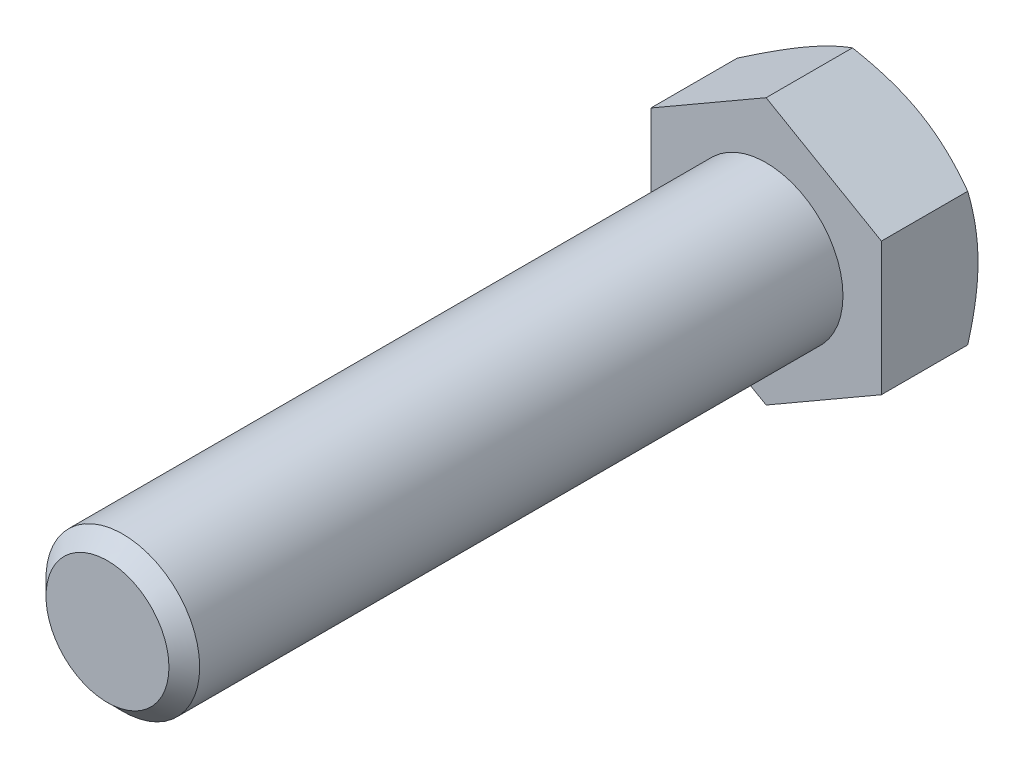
from build123d import *

# Parameters (mm, degrees)
ESQUISSE1_W        = 7
ESQUISSE1_H        = 60
CHANFREIN1_SIZE    = 1.4
BOSS_EXTRU_1_DEPTH = 8.8


with BuildPart() as part:
    # Esquisse1 → Base-R_volution (revolve)
    with BuildSketch(Plane(origin=(0, 0, 0), x_dir=(1, 0, 0), z_dir=(0, 1, 0))):
        with Locations((3.5, -30)):
            Rectangle(ESQUISSE1_W, ESQUISSE1_H)
    revolve(axis=Axis((0, 0, 0), (0, 0, 1)))

    # Chanfrein1
    chanfrein1_edges = [part.edges().sort_by_distance(p)[0] for p in [
        (-7, 0, 60),
    ]]
    chamfer(chanfrein1_edges, length=CHANFREIN1_SIZE)

    # Esquisse6 → Boss.-Extru.1 (add)
    with BuildSketch(Plane.XY):
        Polygon((10.5, -6.062177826), (10.5, 6.062177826), (0, 12.124355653), (-10.5, 6.062177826), (-10.5, -6.062177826), (0, -12.124355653), align=None)
    extrude(amount=-BOSS_EXTRU_1_DEPTH)

    # Esquisse7 → Enl_vement de mati_re-R_volution1 (revolve, cut)
    with BuildSketch(Plane(origin=(0, 0, 0), x_dir=(1, 0, 0), z_dir=(0, 1, 0))):
        Polygon((-10.5, 8.8), (-25.742047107, 8.8), (-25.742047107, 0), align=None)
    revolve(axis=Axis((0, 0, -6.239446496), (0, 0, 1)), mode=Mode.SUBTRACT)


solid = part.part
